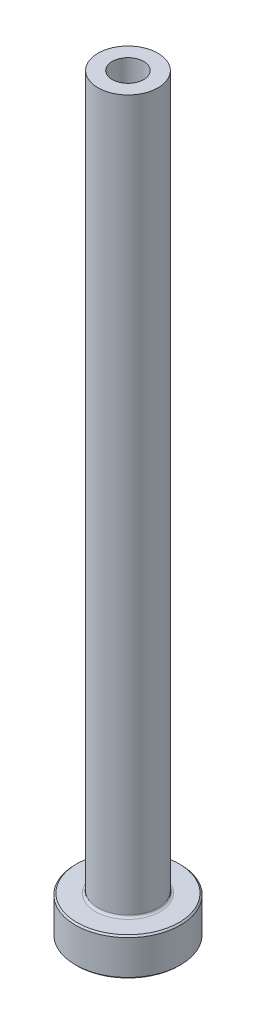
from build123d import *

# Parameters (mm, degrees)
FILLET1_R     = 0.3
CHAMFER1_SIZE = 0.2
CHAMFER3_SIZE = 0.5


with BuildPart() as part:
    # Sketch1 → Revolve1 (revolve)
    with BuildSketch(Plane.XY, mode=Mode.PRIVATE) as revolve1_sk:
        Polygon((-2.1, 100), (-4, 100), (-4, 5), (-7, 5), (-7, 0), (-2.35, 0), (-2.35, 43), (-2.1, 55), align=None)
    revolve(revolve1_sk.sketch.rotate(Axis((0, 92.187680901, 0), (0, -1, 0)), 270), axis=Axis((0, 92.187680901, 0), (0, -1, 0)))

    # Fillet1
    fillet1_edges = [part.edges().sort_by_distance(p)[0] for p in [
        (0, 5, -4),
    ]]
    fillet(fillet1_edges, radius=FILLET1_R)

    # Chamfer1
    chamfer1_edges = [part.edges().sort_by_distance(p)[0] for p in [
        (0, 0, -7),
        (0, 5, -7),
    ]]
    chamfer(chamfer1_edges, length=CHAMFER1_SIZE)

    # Chamfer3
    chamfer3_edges = [part.edges().sort_by_distance(p)[0] for p in [
        (0, 0, -2.35),
    ]]
    chamfer(chamfer3_edges, length=CHAMFER3_SIZE)


solid = part.part
